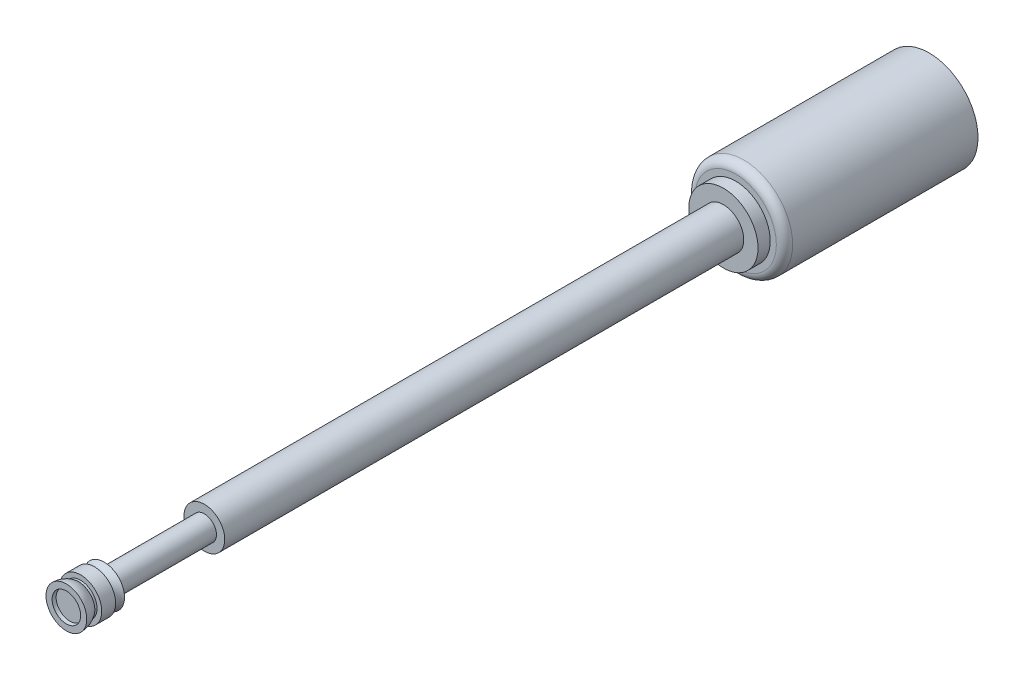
from build123d import *

# Parameters (mm, degrees)
SKETCH_1_R      = 0.5
EXTRUDE_1_DEPTH = 15.5
SKETCH_1_3_R    = 1.2
EXTRUDE_2_DEPTH = 4.75
FILLET_1_R      = 0.2
SKETCH_2_R      = 0.85
EXTRUDE_3_DEPTH = 0.3
SKETCH_4_W      = 0.447113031
SKETCH_4_H      = 0.072680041
SKETCH_5_W      = 0.50048147
SKETCH_5_H      = 2.46


with BuildPart() as part:
    # Sketch 1 → Extrude 1 (new body)
    with BuildSketch(Plane.XY):
        Circle(SKETCH_1_R)
    extrude(amount=EXTRUDE_1_DEPTH)

    # Sketch 1_3 → Extrude 2 (add)
    with BuildSketch(Plane.XY):
        Circle(SKETCH_1_3_R)
    extrude(amount=-EXTRUDE_2_DEPTH)

    # Fillet 1
    fillet_1_edges = [part.edges().sort_by_distance(p)[0] for p in [
        (-0.5, 0, 0),
        (-1.2, 0, 0),
    ]]
    fillet(fillet_1_edges, radius=FILLET_1_R)

    # Sketch 2 → Extrude 3 (add)
    with BuildSketch(Plane.XY):
        Circle(SKETCH_2_R)
    extrude(amount=EXTRUDE_3_DEPTH)

    # Sketch 3 → Revolve 1 (revolve)
    with BuildSketch(Plane(origin=(0, 0, 0), x_dir=(1, 0, 0), z_dir=(0, 1, 0)), mode=Mode.PRIVATE) as revolve_1_sk:
        with BuildLine():
            Line((0.5, -15.5), (0, -15.5))
            Line((0, -15.5), (0, -16.0775))
            ThreePointArc((0, -16.0775), (0.247487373, -16.180012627), (0.35, -16.4275))
            Line((0.35, -16.4275), (0.5, -16.4275))
            ThreePointArc((0.5, -16.4275), (0.475094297, -16.271662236), (0.402858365, -16.131349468))
            Line((0.402858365, -16.131349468), (0.402858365, -16.0775))
            Line((0.402858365, -16.0775), (0.517709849, -16.0775))
            Line((0.517709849, -16.0775), (0.517709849, -15.735812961))
            Line((0.517709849, -15.735812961), (0.402858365, -15.735812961))
            ThreePointArc((0.402858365, -15.735812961), (0.428094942, -15.60829409), (0.5, -15.5))
        make_face()
    revolve(revolve_1_sk.sketch.rotate(Axis((0, 0, 15.5), (0, 0, 1)), 180), axis=Axis((0, 0, 15.5), (0, 0, 1)))

    # Sketch 4 → Revolve 2 (revolve)
    with BuildSketch(Plane(origin=(0, 0, 0), x_dir=(1, 0, 0), z_dir=(0, 1, 0)), mode=Mode.PRIVATE) as revolve_2_sk:
        with Locations((-0.223556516, -16.30365998)):
            Rectangle(SKETCH_4_W, SKETCH_4_H)
    revolve(revolve_2_sk.sketch.rotate(Axis((0, 0, 15.5), (0, 0, 1)), 180), axis=Axis((0, 0, 15.5), (0, 0, 1)))

    # Sketch 5 → Cut-Revolve 1 (revolve, cut)
    with BuildSketch(Plane(origin=(0, 0, 0), x_dir=(1, 0, 0), z_dir=(0, 1, 0)), mode=Mode.PRIVATE) as cut_revolve_1_sk:
        with Locations((-0.546440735, -14.27)):
            Rectangle(SKETCH_5_W, SKETCH_5_H)
    revolve(cut_revolve_1_sk.sketch.rotate(Axis((0, 0, 15.5), (0, 0, 1)), 180), axis=Axis((0, 0, 15.5), (0, 0, 1)), mode=Mode.SUBTRACT)


solid = part.part
